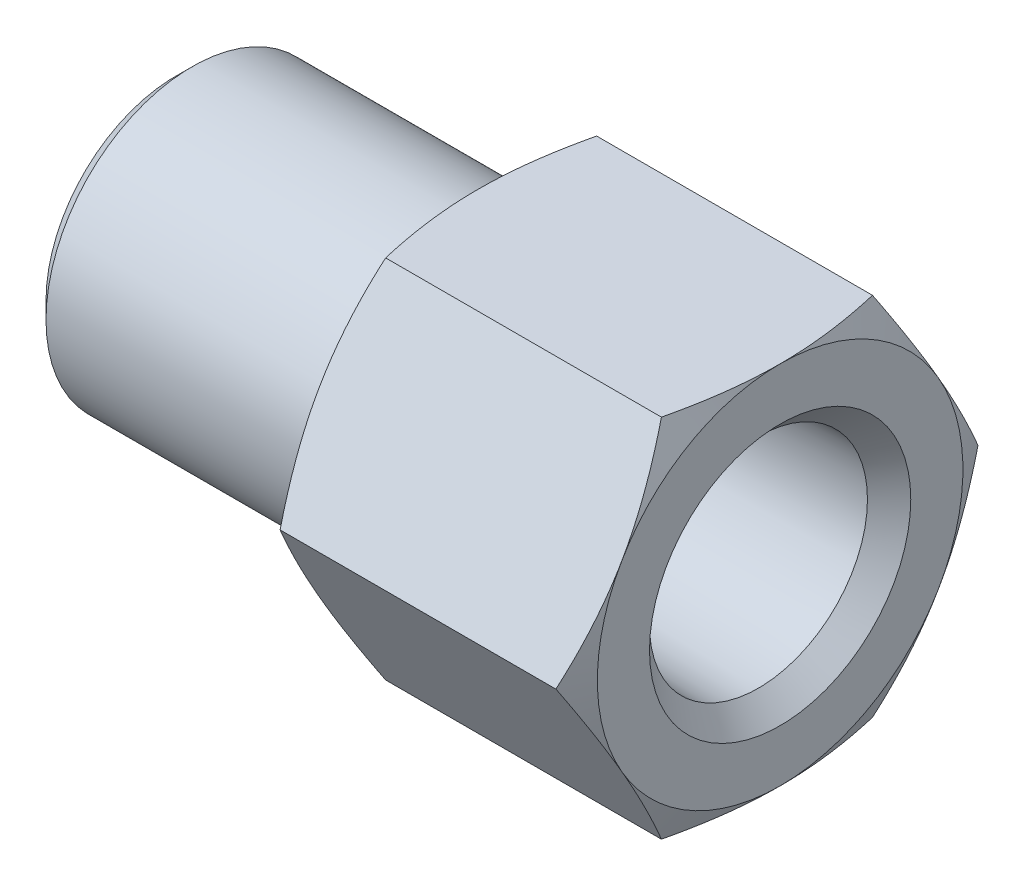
ISO-10303-21;
HEADER;
FILE_DESCRIPTION(('STEP AP214'),'2;1');
FILE_NAME('part.step','',(''),(''),'','','');
FILE_SCHEMA(('AUTOMOTIVE_DESIGN { 1 0 10303 214 1 1 1 1 }'));
ENDSEC;
DATA;
#1=APPLICATION_CONTEXT('core data for automotive mechanical design processes');
#2=APPLICATION_PROTOCOL_DEFINITION('international standard','automotive_design',2000,#1);
#3=PRODUCT_CONTEXT('',#1,'mechanical');
#4=PRODUCT('Part','Part','',(#3));
#5=PRODUCT_RELATED_PRODUCT_CATEGORY('part','',(#4));
#6=PRODUCT_DEFINITION_FORMATION('','',#4);
#7=PRODUCT_DEFINITION_CONTEXT('part definition',#1,'design');
#8=PRODUCT_DEFINITION('design','',#6,#7);
#9=PRODUCT_DEFINITION_SHAPE('','',#8);
#10=(LENGTH_UNIT() NAMED_UNIT(*) SI_UNIT(.MILLI.,.METRE.));
#11=(NAMED_UNIT(*) PLANE_ANGLE_UNIT() SI_UNIT($,.RADIAN.));
#12=(NAMED_UNIT(*) SI_UNIT($,.STERADIAN.) SOLID_ANGLE_UNIT());
#13=UNCERTAINTY_MEASURE_WITH_UNIT(LENGTH_MEASURE(1.E-05),#10,'distance_accuracy_value','');
#14=(GEOMETRIC_REPRESENTATION_CONTEXT(3) GLOBAL_UNCERTAINTY_ASSIGNED_CONTEXT((#13)) GLOBAL_UNIT_ASSIGNED_CONTEXT((#10,
#11,#12)) REPRESENTATION_CONTEXT('',''));
#15=CARTESIAN_POINT('',(0.,0.,0.));
#16=DIRECTION('',(0.,0.,1.));
#17=DIRECTION('',(1.,0.,0.));
#18=AXIS2_PLACEMENT_3D('',#15,#16,#17);
#19=CARTESIAN_POINT('',(30.367224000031,0.,0.));
#20=DIRECTION('',(1.,0.,0.));
#21=DIRECTION('',(0.,1.,0.));
#22=AXIS2_PLACEMENT_3D('',#19,#20,#21);
#23=CONICAL_SURFACE('',#22,5.67931300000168,0.0256563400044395);
#24=CARTESIAN_POINT('',(21.4756999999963,0.,0.));
#25=DIRECTION('',(1.,0.,0.));
#26=DIRECTION('',(0.,1.,0.));
#27=AXIS2_PLACEMENT_3D('',#24,#25,#26);
#28=CIRCLE('',#27,5.45113896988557);
#29=CARTESIAN_POINT('',(21.4756999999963,5.45113896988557,0.));
#30=VERTEX_POINT('',#29);
#31=EDGE_CURVE('E19',#30,#30,#28,.F.);
#32=ORIENTED_EDGE('',*,*,#31,.T.);
#33=EDGE_LOOP('',(#32));
#34=FACE_BOUND('',#33,.T.);
#35=CARTESIAN_POINT('',(30.3672239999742,0.,0.));
#36=DIRECTION('',(1.,0.,0.));
#37=DIRECTION('',(0.,0.,-1.));
#38=AXIS2_PLACEMENT_3D('',#35,#36,#37);
#39=CIRCLE('',#38,5.67931299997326);
#40=CARTESIAN_POINT('',(30.3672239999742,0.,-5.67931299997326));
#41=VERTEX_POINT('',#40);
#42=EDGE_CURVE('E386',#41,#41,#39,.T.);
#43=ORIENTED_EDGE('',*,*,#42,.T.);
#44=EDGE_LOOP('',(#43));
#45=FACE_BOUND('',#44,.T.);
#46=ADVANCED_FACE('F16',(#34,#45),#23,.F.);
#47=CARTESIAN_POINT('',(21.4757,0.,0.));
#48=DIRECTION('',(-1.,0.,0.));
#49=DIRECTION('',(0.,0.,1.));
#50=AXIS2_PLACEMENT_3D('',#47,#48,#49);
#51=PLANE('',#50);
#52=ORIENTED_EDGE('',*,*,#31,.F.);
#53=EDGE_LOOP('',(#52));
#54=FACE_BOUND('',#53,.T.);
#55=CARTESIAN_POINT('',(21.4757,0.,0.));
#56=DIRECTION('',(1.,0.,0.));
#57=DIRECTION('',(0.,0.,-1.));
#58=AXIS2_PLACEMENT_3D('',#55,#56,#57);
#59=CIRCLE('',#58,3.556);
#60=CARTESIAN_POINT('',(21.4757,0.,-3.556));
#61=VERTEX_POINT('',#60);
#62=EDGE_CURVE('E388',#61,#61,#59,.F.);
#63=ORIENTED_EDGE('',*,*,#62,.T.);
#64=EDGE_LOOP('',(#63));
#65=FACE_BOUND('',#64,.T.);
#66=ADVANCED_FACE('F568',(#54,#65),#51,.F.);
#67=CARTESIAN_POINT('',(31.4960000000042,0.,0.));
#68=DIRECTION('',(1.,0.,0.));
#69=DIRECTION('',(0.,0.,-1.));
#70=AXIS2_PLACEMENT_3D('',#67,#68,#69);
#71=CONICAL_SURFACE('',#70,6.80808900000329,0.785398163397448);
#72=ORIENTED_EDGE('',*,*,#42,.F.);
#73=EDGE_LOOP('',(#72));
#74=FACE_BOUND('',#73,.T.);
#75=CARTESIAN_POINT('',(31.4960000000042,0.,0.));
#76=DIRECTION('',(1.,0.,0.));
#77=DIRECTION('',(0.,0.,-1.));
#78=AXIS2_PLACEMENT_3D('',#75,#76,#77);
#79=CIRCLE('',#78,6.80808900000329);
#80=CARTESIAN_POINT('',(31.4960000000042,0.,-6.80808900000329));
#81=VERTEX_POINT('',#80);
#82=EDGE_CURVE('E739',#81,#81,#79,.F.);
#83=ORIENTED_EDGE('',*,*,#82,.F.);
#84=EDGE_LOOP('',(#83));
#85=FACE_BOUND('',#84,.T.);
#86=ADVANCED_FACE('F560',(#74,#85),#71,.F.);
#87=CARTESIAN_POINT('',(23.622,0.,0.));
#88=DIRECTION('',(1.,0.,0.));
#89=DIRECTION('',(0.,0.,-1.));
#90=AXIS2_PLACEMENT_3D('',#87,#88,#89);
#91=CYLINDRICAL_SURFACE('',#90,3.556);
#92=ORIENTED_EDGE('',*,*,#62,.F.);
#93=EDGE_LOOP('',(#92));
#94=FACE_BOUND('',#93,.T.);
#95=CARTESIAN_POINT('',(7.874,0.,0.));
#96=DIRECTION('',(1.,0.,0.));
#97=DIRECTION('',(0.,0.,-1.));
#98=AXIS2_PLACEMENT_3D('',#95,#96,#97);
#99=CIRCLE('',#98,3.556);
#100=CARTESIAN_POINT('',(7.874,0.,-3.556));
#101=VERTEX_POINT('',#100);
#102=EDGE_CURVE('E131',#101,#101,#99,.F.);
#103=ORIENTED_EDGE('',*,*,#102,.T.);
#104=EDGE_LOOP('',(#103));
#105=FACE_BOUND('',#104,.T.);
#106=ADVANCED_FACE('F554',(#94,#105),#91,.F.);
#107=CARTESIAN_POINT('',(31.496,0.,4.7625));
#108=DIRECTION('',(1.,0.,0.));
#109=DIRECTION('',(0.,1.,0.));
#110=AXIS2_PLACEMENT_3D('',#107,#108,#109);
#111=PLANE('',#110);
#112=CARTESIAN_POINT('',(31.496,0.,0.));
#113=DIRECTION('',(-1.,0.,0.));
#114=DIRECTION('',(0.,0.,1.));
#115=AXIS2_PLACEMENT_3D('',#112,#113,#114);
#116=CIRCLE('',#115,9.525);
#117=CARTESIAN_POINT('',(31.496,4.7625,-8.24889197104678));
#118=VERTEX_POINT('',#117);
#119=CARTESIAN_POINT('',(31.496,-4.7625,-8.24889197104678));
#120=VERTEX_POINT('',#119);
#121=EDGE_CURVE('E104',#118,#120,#116,.T.);
#122=ORIENTED_EDGE('',*,*,#121,.F.);
#123=CARTESIAN_POINT('',(31.496,0.,0.));
#124=DIRECTION('',(-1.,0.,0.));
#125=DIRECTION('',(0.,0.,1.));
#126=AXIS2_PLACEMENT_3D('',#123,#124,#125);
#127=CIRCLE('',#126,9.525);
#128=CARTESIAN_POINT('',(31.496,9.525,0.));
#129=VERTEX_POINT('',#128);
#130=EDGE_CURVE('E101',#129,#118,#127,.T.);
#131=ORIENTED_EDGE('',*,*,#130,.F.);
#132=CARTESIAN_POINT('',(31.496,0.,0.));
#133=DIRECTION('',(-1.,0.,0.));
#134=DIRECTION('',(0.,0.,1.));
#135=AXIS2_PLACEMENT_3D('',#132,#133,#134);
#136=CIRCLE('',#135,9.52499999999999);
#137=CARTESIAN_POINT('',(31.496,4.76250000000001,8.24889197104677));
#138=VERTEX_POINT('',#137);
#139=EDGE_CURVE('E746',#138,#129,#136,.T.);
#140=ORIENTED_EDGE('',*,*,#139,.F.);
#141=CARTESIAN_POINT('',(31.496,0.,0.));
#142=DIRECTION('',(-1.,0.,0.));
#143=DIRECTION('',(0.,0.,1.));
#144=AXIS2_PLACEMENT_3D('',#141,#142,#143);
#145=CIRCLE('',#144,9.52499999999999);
#146=CARTESIAN_POINT('',(31.496,-4.76249999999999,8.24889197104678));
#147=VERTEX_POINT('',#146);
#148=EDGE_CURVE('E751',#147,#138,#145,.T.);
#149=ORIENTED_EDGE('',*,*,#148,.F.);
#150=CARTESIAN_POINT('',(31.496,0.,0.));
#151=DIRECTION('',(-1.,0.,0.));
#152=DIRECTION('',(0.,0.,1.));
#153=AXIS2_PLACEMENT_3D('',#150,#151,#152);
#154=CIRCLE('',#153,9.525);
#155=CARTESIAN_POINT('',(31.496,-9.525,0.));
#156=VERTEX_POINT('',#155);
#157=EDGE_CURVE('E748',#156,#147,#154,.T.);
#158=ORIENTED_EDGE('',*,*,#157,.F.);
#159=CARTESIAN_POINT('',(31.496,0.,0.));
#160=DIRECTION('',(-1.,0.,0.));
#161=DIRECTION('',(0.,0.,1.));
#162=AXIS2_PLACEMENT_3D('',#159,#160,#161);
#163=CIRCLE('',#162,9.525);
#164=EDGE_CURVE('E109',#120,#156,#163,.T.);
#165=ORIENTED_EDGE('',*,*,#164,.F.);
#166=EDGE_LOOP('',(#122,#131,#140,#149,#158,#165));
#167=FACE_BOUND('',#166,.T.);
#168=ORIENTED_EDGE('',*,*,#82,.T.);
#169=EDGE_LOOP('',(#168));
#170=FACE_BOUND('',#169,.T.);
#171=ADVANCED_FACE('F106',(#167,#170),#111,.T.);
#172=CARTESIAN_POINT('',(7.874,0.,0.));
#173=DIRECTION('',(1.,0.,0.));
#174=DIRECTION('',(0.,1.,0.));
#175=AXIS2_PLACEMENT_3D('',#172,#173,#174);
#176=PLANE('',#175);
#177=CARTESIAN_POINT('',(7.874,0.,0.));
#178=DIRECTION('',(1.,0.,0.));
#179=DIRECTION('',(0.,0.,-1.));
#180=AXIS2_PLACEMENT_3D('',#177,#178,#179);
#181=CIRCLE('',#180,4.7625);
#182=CARTESIAN_POINT('',(7.874,0.,-4.7625));
#183=VERTEX_POINT('',#182);
#184=EDGE_CURVE('E753',#183,#183,#181,.F.);
#185=ORIENTED_EDGE('',*,*,#184,.T.);
#186=EDGE_LOOP('',(#185));
#187=FACE_BOUND('',#186,.T.);
#188=ORIENTED_EDGE('',*,*,#102,.F.);
#189=EDGE_LOOP('',(#188));
#190=FACE_BOUND('',#189,.T.);
#191=ADVANCED_FACE('F160',(#187,#190),#176,.F.);
#192=CARTESIAN_POINT('',(30.8047624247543,0.,0.));
#193=DIRECTION('',(-1.,0.,0.));
#194=DIRECTION('',(0.,0.,1.));
#195=AXIS2_PLACEMENT_3D('',#192,#193,#194);
#196=CONICAL_SURFACE('',#195,11.0073637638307,1.13446401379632);
#197=CARTESIAN_POINT('',(31.496,9.525,0.));
#198=CARTESIAN_POINT('',(31.4960275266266,9.525,-0.231936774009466));
#199=CARTESIAN_POINT('',(31.4920502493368,9.525,-0.463867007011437));
#200=CARTESIAN_POINT('',(31.4762898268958,9.525,-0.927436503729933));
#201=CARTESIAN_POINT('',(31.4645075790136,9.525,-1.1590757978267));
#202=CARTESIAN_POINT('',(31.4333927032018,9.525,-1.62106931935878));
#203=CARTESIAN_POINT('',(31.414085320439,9.525,-1.85142525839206));
#204=CARTESIAN_POINT('',(31.3682940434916,9.525,-2.31142034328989));
#205=CARTESIAN_POINT('',(31.3418100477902,9.525,-2.54105947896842));
#206=CARTESIAN_POINT('',(31.2523093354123,9.525,-3.22827483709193));
#207=CARTESIAN_POINT('',(31.179216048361,9.525,-3.68454136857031));
#208=CARTESIAN_POINT('',(31.0101598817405,9.525,-4.59444540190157));
#209=CARTESIAN_POINT('',(30.9141207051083,9.525,-5.04806884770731));
#210=CARTESIAN_POINT('',(30.8088851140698,9.525,-5.49926131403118));
#211=B_SPLINE_CURVE_WITH_KNOTS('',3,(#197,#198,#199,#200,#201,#202,#203,#204,#205,#206,#207,
#208,#209,#210),.UNSPECIFIED.,.F.,.F.,(4,2,2,2,2,2,4),(0.,0.695765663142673,1.39145135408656,
2.08482298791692,2.77820443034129,4.1637893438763,5.55404718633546),.UNSPECIFIED.);
#212=CARTESIAN_POINT('',(30.8088851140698,9.525,-5.49926131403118));
#213=VERTEX_POINT('',#212);
#214=EDGE_CURVE('E122',#129,#213,#211,.T.);
#215=ORIENTED_EDGE('',*,*,#214,.F.);
#216=ORIENTED_EDGE('',*,*,#130,.T.);
#217=CARTESIAN_POINT('',(30.8088851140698,9.525,-5.49926131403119));
#218=CARTESIAN_POINT('',(30.9141207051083,9.13425586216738,-5.72485754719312));
#219=CARTESIAN_POINT('',(31.0101598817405,8.74140643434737,-5.95166927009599));
#220=CARTESIAN_POINT('',(31.179216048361,7.95340642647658,-6.40662128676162));
#221=CARTESIAN_POINT('',(31.2523093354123,7.55826801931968,-6.63475455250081));
#222=CARTESIAN_POINT('',(31.3418100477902,6.9631220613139,-6.97836223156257));
#223=CARTESIAN_POINT('',(31.3682940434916,6.7642487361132,-7.09318179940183));
#224=CARTESIAN_POINT('',(31.414085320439,6.3658813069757,-7.32317934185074));
#225=CARTESIAN_POINT('',(31.4333927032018,6.16638721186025,-7.43835731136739));
#226=CARTESIAN_POINT('',(31.4645075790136,5.76628908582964,-7.66935407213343));
#227=CARTESIAN_POINT('',(31.4762898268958,5.56568357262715,-7.78517371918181));
#228=CARTESIAN_POINT('',(31.4920502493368,5.16422061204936,-8.01695846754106));
#229=CARTESIAN_POINT('',(31.4960275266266,4.96336313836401,-8.13292358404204));
#230=CARTESIAN_POINT('',(31.496,4.7625,-8.24889197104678));
#231=B_SPLINE_CURVE_WITH_KNOTS('',3,(#217,#218,#219,#220,#221,#222,#223,#224,#225,#226,#227,
#228,#229,#230),.UNSPECIFIED.,.F.,.F.,(4,2,2,2,2,2,4),(0.,1.39025784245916,2.77584275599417,
3.46922419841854,4.1625958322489,4.85828152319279,5.55404718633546),.UNSPECIFIED.);
#232=EDGE_CURVE('E128',#213,#118,#231,.T.);
#233=ORIENTED_EDGE('',*,*,#232,.F.);
#234=EDGE_LOOP('',(#215,#216,#233));
#235=FACE_BOUND('',#234,.T.);
#236=ADVANCED_FACE('F127',(#235),#196,.T.);
#237=CARTESIAN_POINT('',(30.8047624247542,0.,0.));
#238=DIRECTION('',(-1.,0.,0.));
#239=DIRECTION('',(0.,0.,1.));
#240=AXIS2_PLACEMENT_3D('',#237,#238,#239);
#241=CONICAL_SURFACE('',#240,11.0073637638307,1.13446401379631);
#242=CARTESIAN_POINT('',(31.496,4.7625,-8.24889197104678));
#243=CARTESIAN_POINT('',(31.4960275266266,4.56163686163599,-8.36486035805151));
#244=CARTESIAN_POINT('',(31.4920502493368,4.36077938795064,-8.4808254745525));
#245=CARTESIAN_POINT('',(31.4762898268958,3.95931642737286,-8.71261022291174));
#246=CARTESIAN_POINT('',(31.4645075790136,3.75871091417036,-8.82842986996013));
#247=CARTESIAN_POINT('',(31.4333927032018,3.35861278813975,-9.05942663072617));
#248=CARTESIAN_POINT('',(31.414085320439,3.1591186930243,-9.17460460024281));
#249=CARTESIAN_POINT('',(31.3682940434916,2.7607512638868,-9.40460214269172));
#250=CARTESIAN_POINT('',(31.3418100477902,2.5618779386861,-9.51942171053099));
#251=CARTESIAN_POINT('',(31.2523093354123,1.96673198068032,-9.86302938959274));
#252=CARTESIAN_POINT('',(31.179216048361,1.57159357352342,-10.0911626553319));
#253=CARTESIAN_POINT('',(31.0101598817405,0.783593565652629,-10.5461146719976));
#254=CARTESIAN_POINT('',(30.9141207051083,0.390744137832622,-10.7729263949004));
#255=CARTESIAN_POINT('',(30.8088851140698,0.,-10.9985226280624));
#256=B_SPLINE_CURVE_WITH_KNOTS('',3,(#242,#243,#244,#245,#246,#247,#248,#249,#250,#251,#252,
#253,#254,#255),.UNSPECIFIED.,.F.,.F.,(4,2,2,2,2,2,4),(0.,0.695765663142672,1.39145135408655,
2.08482298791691,2.77820443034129,4.1637893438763,5.55404718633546),.UNSPECIFIED.);
#257=CARTESIAN_POINT('',(30.8088851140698,0.,-10.9985226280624));
#258=VERTEX_POINT('',#257);
#259=EDGE_CURVE('E114',#118,#258,#256,.T.);
#260=ORIENTED_EDGE('',*,*,#259,.F.);
#261=ORIENTED_EDGE('',*,*,#121,.T.);
#262=CARTESIAN_POINT('',(30.8088851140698,0.,-10.9985226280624));
#263=CARTESIAN_POINT('',(30.9141207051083,-0.390744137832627,-10.7729263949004));
#264=CARTESIAN_POINT('',(31.0101598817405,-0.783593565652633,-10.5461146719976));
#265=CARTESIAN_POINT('',(31.179216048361,-1.57159357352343,-10.0911626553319));
#266=CARTESIAN_POINT('',(31.2523093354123,-1.96673198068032,-9.86302938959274));
#267=CARTESIAN_POINT('',(31.3418100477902,-2.5618779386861,-9.51942171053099));
#268=CARTESIAN_POINT('',(31.3682940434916,-2.76075126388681,-9.40460214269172));
#269=CARTESIAN_POINT('',(31.414085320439,-3.15911869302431,-9.17460460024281));
#270=CARTESIAN_POINT('',(31.4333927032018,-3.35861278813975,-9.05942663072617));
#271=CARTESIAN_POINT('',(31.4645075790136,-3.75871091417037,-8.82842986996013));
#272=CARTESIAN_POINT('',(31.4762898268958,-3.95931642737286,-8.71261022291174));
#273=CARTESIAN_POINT('',(31.4920502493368,-4.36077938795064,-8.4808254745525));
#274=CARTESIAN_POINT('',(31.4960275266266,-4.56163686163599,-8.36486035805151));
#275=CARTESIAN_POINT('',(31.496,-4.7625,-8.24889197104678));
#276=B_SPLINE_CURVE_WITH_KNOTS('',3,(#262,#263,#264,#265,#266,#267,#268,#269,#270,#271,#272,
#273,#274,#275),.UNSPECIFIED.,.F.,.F.,(4,2,2,2,2,2,4),(0.,1.39025784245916,2.77584275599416,
3.46922419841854,4.1625958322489,4.85828152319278,5.55404718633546),.UNSPECIFIED.);
#277=EDGE_CURVE('E117',#258,#120,#276,.T.);
#278=ORIENTED_EDGE('',*,*,#277,.F.);
#279=EDGE_LOOP('',(#260,#261,#278));
#280=FACE_BOUND('',#279,.T.);
#281=ADVANCED_FACE('F115',(#280),#241,.T.);
#282=CARTESIAN_POINT('',(30.8047624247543,0.,0.));
#283=DIRECTION('',(-1.,0.,0.));
#284=DIRECTION('',(0.,0.,1.));
#285=AXIS2_PLACEMENT_3D('',#282,#283,#284);
#286=CONICAL_SURFACE('',#285,11.0073637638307,1.13446401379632);
#287=CARTESIAN_POINT('',(31.496,-4.7625,-8.24889197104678));
#288=CARTESIAN_POINT('',(31.4960275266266,-4.96336313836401,-8.13292358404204));
#289=CARTESIAN_POINT('',(31.4920502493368,-5.16422061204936,-8.01695846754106));
#290=CARTESIAN_POINT('',(31.4762898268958,-5.56568357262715,-7.78517371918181));
#291=CARTESIAN_POINT('',(31.4645075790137,-5.76628908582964,-7.66935407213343));
#292=CARTESIAN_POINT('',(31.4333927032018,-6.16638721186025,-7.43835731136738));
#293=CARTESIAN_POINT('',(31.414085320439,-6.3658813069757,-7.32317934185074));
#294=CARTESIAN_POINT('',(31.3682940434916,-6.7642487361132,-7.09318179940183));
#295=CARTESIAN_POINT('',(31.3418100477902,-6.9631220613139,-6.97836223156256));
#296=CARTESIAN_POINT('',(31.2523093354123,-7.55826801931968,-6.63475455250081));
#297=CARTESIAN_POINT('',(31.179216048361,-7.95340642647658,-6.40662128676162));
#298=CARTESIAN_POINT('',(31.0101598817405,-8.74140643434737,-5.95166927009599));
#299=CARTESIAN_POINT('',(30.9141207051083,-9.13425586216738,-5.72485754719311));
#300=CARTESIAN_POINT('',(30.8088851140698,-9.525,-5.49926131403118));
#301=B_SPLINE_CURVE_WITH_KNOTS('',3,(#287,#288,#289,#290,#291,#292,#293,#294,#295,#296,#297,
#298,#299,#300),.UNSPECIFIED.,.F.,.F.,(4,2,2,2,2,2,4),(0.,0.695765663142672,1.39145135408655,
2.08482298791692,2.77820443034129,4.1637893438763,5.55404718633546),.UNSPECIFIED.);
#302=CARTESIAN_POINT('',(30.8088851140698,-9.525,-5.49926131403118));
#303=VERTEX_POINT('',#302);
#304=EDGE_CURVE('E299',#120,#303,#301,.T.);
#305=ORIENTED_EDGE('',*,*,#304,.F.);
#306=ORIENTED_EDGE('',*,*,#164,.T.);
#307=CARTESIAN_POINT('',(30.8088851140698,-9.525,-5.49926131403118));
#308=CARTESIAN_POINT('',(30.9141207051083,-9.525,-5.04806884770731));
#309=CARTESIAN_POINT('',(31.0101598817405,-9.525,-4.59444540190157));
#310=CARTESIAN_POINT('',(31.179216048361,-9.525,-3.68454136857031));
#311=CARTESIAN_POINT('',(31.2523093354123,-9.525,-3.22827483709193));
#312=CARTESIAN_POINT('',(31.3418100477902,-9.525,-2.54105947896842));
#313=CARTESIAN_POINT('',(31.3682940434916,-9.525,-2.31142034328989));
#314=CARTESIAN_POINT('',(31.414085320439,-9.525,-1.85142525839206));
#315=CARTESIAN_POINT('',(31.4333927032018,-9.525,-1.62106931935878));
#316=CARTESIAN_POINT('',(31.4645075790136,-9.525,-1.15907579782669));
#317=CARTESIAN_POINT('',(31.4762898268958,-9.525,-0.927436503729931));
#318=CARTESIAN_POINT('',(31.4920502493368,-9.525,-0.463867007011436));
#319=CARTESIAN_POINT('',(31.4960275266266,-9.525,-0.231936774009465));
#320=CARTESIAN_POINT('',(31.496,-9.525,0.));
#321=B_SPLINE_CURVE_WITH_KNOTS('',3,(#307,#308,#309,#310,#311,#312,#313,#314,#315,#316,#317,
#318,#319,#320),.UNSPECIFIED.,.F.,.F.,(4,2,2,2,2,2,4),(0.,1.39025784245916,2.77584275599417,
3.46922419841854,4.1625958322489,4.85828152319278,5.55404718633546),.UNSPECIFIED.);
#322=EDGE_CURVE('E284',#303,#156,#321,.T.);
#323=ORIENTED_EDGE('',*,*,#322,.F.);
#324=EDGE_LOOP('',(#305,#306,#323));
#325=FACE_BOUND('',#324,.T.);
#326=ADVANCED_FACE('F292',(#325),#286,.T.);
#327=CARTESIAN_POINT('',(30.8047624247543,0.,0.));
#328=DIRECTION('',(-1.,0.,0.));
#329=DIRECTION('',(0.,0.,1.));
#330=AXIS2_PLACEMENT_3D('',#327,#328,#329);
#331=CONICAL_SURFACE('',#330,11.0073637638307,1.13446401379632);
#332=ORIENTED_EDGE('',*,*,#139,.T.);
#333=CARTESIAN_POINT('',(30.8088851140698,9.525,5.49926131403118));
#334=CARTESIAN_POINT('',(30.9141207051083,9.525,5.04806884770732));
#335=CARTESIAN_POINT('',(31.0101598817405,9.525,4.59444540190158));
#336=CARTESIAN_POINT('',(31.179216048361,9.525,3.68454136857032));
#337=CARTESIAN_POINT('',(31.2523093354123,9.525,3.22827483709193));
#338=CARTESIAN_POINT('',(31.3418100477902,9.525,2.54105947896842));
#339=CARTESIAN_POINT('',(31.3682940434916,9.525,2.3114203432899));
#340=CARTESIAN_POINT('',(31.414085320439,9.525,1.85142525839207));
#341=CARTESIAN_POINT('',(31.4333927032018,9.525,1.62106931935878));
#342=CARTESIAN_POINT('',(31.4645075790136,9.525,1.1590757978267));
#343=CARTESIAN_POINT('',(31.4762898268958,9.525,0.927436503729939));
#344=CARTESIAN_POINT('',(31.4920502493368,9.525,0.463867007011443));
#345=CARTESIAN_POINT('',(31.4960275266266,9.525,0.231936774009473));
#346=CARTESIAN_POINT('',(31.496,9.525,0.));
#347=B_SPLINE_CURVE_WITH_KNOTS('',3,(#333,#334,#335,#336,#337,#338,#339,#340,#341,#342,#343,
#344,#345,#346),.UNSPECIFIED.,.F.,.F.,(4,2,2,2,2,2,4),(0.,1.39025784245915,2.77584275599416,
3.46922419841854,4.1625958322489,4.85828152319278,5.55404718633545),.UNSPECIFIED.);
#348=CARTESIAN_POINT('',(30.8088851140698,9.525,5.49926131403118));
#349=VERTEX_POINT('',#348);
#350=EDGE_CURVE('E169',#349,#129,#347,.T.);
#351=ORIENTED_EDGE('',*,*,#350,.F.);
#352=CARTESIAN_POINT('',(31.496,4.76250000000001,8.24889197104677));
#353=CARTESIAN_POINT('',(31.4960275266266,4.96336313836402,8.13292358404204));
#354=CARTESIAN_POINT('',(31.4920502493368,5.16422061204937,8.01695846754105));
#355=CARTESIAN_POINT('',(31.4762898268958,5.56568357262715,7.7851737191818));
#356=CARTESIAN_POINT('',(31.4645075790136,5.76628908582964,7.66935407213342));
#357=CARTESIAN_POINT('',(31.4333927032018,6.16638721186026,7.43835731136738));
#358=CARTESIAN_POINT('',(31.414085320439,6.3658813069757,7.32317934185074));
#359=CARTESIAN_POINT('',(31.3682940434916,6.7642487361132,7.09318179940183));
#360=CARTESIAN_POINT('',(31.3418100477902,6.9631220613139,6.97836223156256));
#361=CARTESIAN_POINT('',(31.2523093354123,7.55826801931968,6.63475455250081));
#362=CARTESIAN_POINT('',(31.179216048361,7.95340642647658,6.40662128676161));
#363=CARTESIAN_POINT('',(31.0101598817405,8.74140643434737,5.95166927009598));
#364=CARTESIAN_POINT('',(30.9141207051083,9.13425586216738,5.72485754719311));
#365=CARTESIAN_POINT('',(30.8088851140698,9.52499999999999,5.49926131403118));
#366=B_SPLINE_CURVE_WITH_KNOTS('',3,(#352,#353,#354,#355,#356,#357,#358,#359,#360,#361,#362,
#363,#364,#365),.UNSPECIFIED.,.F.,.F.,(4,2,2,2,2,2,4),(0.,0.695765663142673,1.39145135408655,
2.08482298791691,2.77820443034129,4.16378934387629,5.55404718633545),.UNSPECIFIED.);
#367=EDGE_CURVE('E278',#138,#349,#366,.T.);
#368=ORIENTED_EDGE('',*,*,#367,.F.);
#369=EDGE_LOOP('',(#332,#351,#368));
#370=FACE_BOUND('',#369,.T.);
#371=ADVANCED_FACE('F289',(#370),#331,.T.);
#372=CARTESIAN_POINT('',(30.8047624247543,0.,0.));
#373=DIRECTION('',(-1.,0.,0.));
#374=DIRECTION('',(0.,0.,1.));
#375=AXIS2_PLACEMENT_3D('',#372,#373,#374);
#376=CONICAL_SURFACE('',#375,11.0073637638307,1.13446401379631);
#377=CARTESIAN_POINT('',(31.496,-9.525,0.));
#378=CARTESIAN_POINT('',(31.4960275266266,-9.525,0.231936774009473));
#379=CARTESIAN_POINT('',(31.4920502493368,-9.525,0.463867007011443));
#380=CARTESIAN_POINT('',(31.4762898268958,-9.525,0.927436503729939));
#381=CARTESIAN_POINT('',(31.4645075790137,-9.525,1.1590757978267));
#382=CARTESIAN_POINT('',(31.4333927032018,-9.525,1.62106931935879));
#383=CARTESIAN_POINT('',(31.414085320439,-9.525,1.85142525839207));
#384=CARTESIAN_POINT('',(31.3682940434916,-9.525,2.3114203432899));
#385=CARTESIAN_POINT('',(31.3418100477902,-9.525,2.54105947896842));
#386=CARTESIAN_POINT('',(31.2523093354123,-9.525,3.22827483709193));
#387=CARTESIAN_POINT('',(31.179216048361,-9.525,3.68454136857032));
#388=CARTESIAN_POINT('',(31.0101598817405,-9.525,4.59444540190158));
#389=CARTESIAN_POINT('',(30.9141207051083,-9.525,5.04806884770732));
#390=CARTESIAN_POINT('',(30.8088851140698,-9.525,5.49926131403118));
#391=B_SPLINE_CURVE_WITH_KNOTS('',3,(#377,#378,#379,#380,#381,#382,#383,#384,#385,#386,#387,
#388,#389,#390),.UNSPECIFIED.,.F.,.F.,(4,2,2,2,2,2,4),(0.,0.695765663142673,1.39145135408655,
2.08482298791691,2.77820443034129,4.1637893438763,5.55404718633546),.UNSPECIFIED.);
#392=CARTESIAN_POINT('',(30.8088851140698,-9.525,5.49926131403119));
#393=VERTEX_POINT('',#392);
#394=EDGE_CURVE('E303',#156,#393,#391,.T.);
#395=ORIENTED_EDGE('',*,*,#394,.F.);
#396=ORIENTED_EDGE('',*,*,#157,.T.);
#397=CARTESIAN_POINT('',(30.8088851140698,-9.525,5.49926131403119));
#398=CARTESIAN_POINT('',(30.9141207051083,-9.13425586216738,5.72485754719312));
#399=CARTESIAN_POINT('',(31.0101598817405,-8.74140643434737,5.95166927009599));
#400=CARTESIAN_POINT('',(31.179216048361,-7.95340642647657,6.40662128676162));
#401=CARTESIAN_POINT('',(31.2523093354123,-7.55826801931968,6.63475455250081));
#402=CARTESIAN_POINT('',(31.3418100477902,-6.9631220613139,6.97836223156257));
#403=CARTESIAN_POINT('',(31.3682940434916,-6.76424873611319,7.09318179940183));
#404=CARTESIAN_POINT('',(31.414085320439,-6.36588130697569,7.32317934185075));
#405=CARTESIAN_POINT('',(31.4333927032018,-6.16638721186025,7.43835731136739));
#406=CARTESIAN_POINT('',(31.4645075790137,-5.76628908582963,7.66935407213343));
#407=CARTESIAN_POINT('',(31.4762898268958,-5.56568357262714,7.78517371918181));
#408=CARTESIAN_POINT('',(31.4920502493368,-5.16422061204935,8.01695846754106));
#409=CARTESIAN_POINT('',(31.4960275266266,-4.963363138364,8.13292358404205));
#410=CARTESIAN_POINT('',(31.496,-4.76249999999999,8.24889197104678));
#411=B_SPLINE_CURVE_WITH_KNOTS('',3,(#397,#398,#399,#400,#401,#402,#403,#404,#405,#406,#407,
#408,#409,#410),.UNSPECIFIED.,.F.,.F.,(4,2,2,2,2,2,4),(0.,1.39025784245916,2.77584275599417,
3.46922419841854,4.16259583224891,4.85828152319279,5.55404718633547),.UNSPECIFIED.);
#412=EDGE_CURVE('E256',#393,#147,#411,.T.);
#413=ORIENTED_EDGE('',*,*,#412,.F.);
#414=EDGE_LOOP('',(#395,#396,#413));
#415=FACE_BOUND('',#414,.T.);
#416=ADVANCED_FACE('F266',(#415),#376,.T.);
#417=CARTESIAN_POINT('',(30.8047624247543,0.,0.));
#418=DIRECTION('',(-1.,0.,0.));
#419=DIRECTION('',(0.,0.,1.));
#420=AXIS2_PLACEMENT_3D('',#417,#418,#419);
#421=CONICAL_SURFACE('',#420,11.0073637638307,1.13446401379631);
#422=CARTESIAN_POINT('',(31.496,-4.76249999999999,8.24889197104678));
#423=CARTESIAN_POINT('',(31.4960275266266,-4.56163686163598,8.36486035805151));
#424=CARTESIAN_POINT('',(31.4920502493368,-4.36077938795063,8.4808254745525));
#425=CARTESIAN_POINT('',(31.4762898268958,-3.95931642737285,8.71261022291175));
#426=CARTESIAN_POINT('',(31.4645075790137,-3.75871091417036,8.82842986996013));
#427=CARTESIAN_POINT('',(31.4333927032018,-3.35861278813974,9.05942663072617));
#428=CARTESIAN_POINT('',(31.414085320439,-3.1591186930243,9.17460460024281));
#429=CARTESIAN_POINT('',(31.3682940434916,-2.7607512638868,9.40460214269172));
#430=CARTESIAN_POINT('',(31.3418100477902,-2.56187793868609,9.51942171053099));
#431=CARTESIAN_POINT('',(31.2523093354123,-1.96673198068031,9.86302938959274));
#432=CARTESIAN_POINT('',(31.179216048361,-1.57159357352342,10.0911626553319));
#433=CARTESIAN_POINT('',(31.0101598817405,-0.783593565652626,10.5461146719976));
#434=CARTESIAN_POINT('',(30.9141207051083,-0.39074413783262,10.7729263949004));
#435=CARTESIAN_POINT('',(30.8088851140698,0.,10.9985226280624));
#436=B_SPLINE_CURVE_WITH_KNOTS('',3,(#422,#423,#424,#425,#426,#427,#428,#429,#430,#431,#432,
#433,#434,#435),.UNSPECIFIED.,.F.,.F.,(4,2,2,2,2,2,4),(0.,0.695765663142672,1.39145135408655,
2.08482298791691,2.77820443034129,4.1637893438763,5.55404718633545),.UNSPECIFIED.);
#437=CARTESIAN_POINT('',(30.8088851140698,0.,10.9985226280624));
#438=VERTEX_POINT('',#437);
#439=EDGE_CURVE('E250',#147,#438,#436,.T.);
#440=ORIENTED_EDGE('',*,*,#439,.F.);
#441=ORIENTED_EDGE('',*,*,#148,.T.);
#442=CARTESIAN_POINT('',(30.8088851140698,0.,10.9985226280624));
#443=CARTESIAN_POINT('',(30.9141207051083,0.39074413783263,10.7729263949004));
#444=CARTESIAN_POINT('',(31.0101598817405,0.783593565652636,10.5461146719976));
#445=CARTESIAN_POINT('',(31.179216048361,1.57159357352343,10.0911626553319));
#446=CARTESIAN_POINT('',(31.2523093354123,1.96673198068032,9.86302938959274));
#447=CARTESIAN_POINT('',(31.3418100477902,2.5618779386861,9.51942171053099));
#448=CARTESIAN_POINT('',(31.3682940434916,2.76075126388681,9.40460214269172));
#449=CARTESIAN_POINT('',(31.414085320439,3.15911869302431,9.17460460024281));
#450=CARTESIAN_POINT('',(31.4333927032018,3.35861278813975,9.05942663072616));
#451=CARTESIAN_POINT('',(31.4645075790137,3.75871091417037,8.82842986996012));
#452=CARTESIAN_POINT('',(31.4762898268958,3.95931642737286,8.71261022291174));
#453=CARTESIAN_POINT('',(31.4920502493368,4.36077938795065,8.48082547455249));
#454=CARTESIAN_POINT('',(31.4960275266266,4.561636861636,8.36486035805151));
#455=CARTESIAN_POINT('',(31.496,4.76250000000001,8.24889197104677));
#456=B_SPLINE_CURVE_WITH_KNOTS('',3,(#442,#443,#444,#445,#446,#447,#448,#449,#450,#451,#452,
#453,#454,#455),.UNSPECIFIED.,.F.,.F.,(4,2,2,2,2,2,4),(0.,1.39025784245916,2.77584275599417,
3.46922419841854,4.1625958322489,4.85828152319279,5.55404718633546),.UNSPECIFIED.);
#457=EDGE_CURVE('E270',#438,#138,#456,.T.);
#458=ORIENTED_EDGE('',*,*,#457,.F.);
#459=EDGE_LOOP('',(#440,#441,#458));
#460=FACE_BOUND('',#459,.T.);
#461=ADVANCED_FACE('F263',(#460),#421,.T.);
#462=CARTESIAN_POINT('',(3.937,0.,0.));
#463=DIRECTION('',(1.,0.,0.));
#464=DIRECTION('',(0.,0.,-1.));
#465=AXIS2_PLACEMENT_3D('',#462,#463,#464);
#466=CYLINDRICAL_SURFACE('',#465,4.7625);
#467=CARTESIAN_POINT('',(0.,0.,0.));
#468=DIRECTION('',(1.,0.,0.));
#469=DIRECTION('',(0.,0.,-1.));
#470=AXIS2_PLACEMENT_3D('',#467,#468,#469);
#471=CIRCLE('',#470,4.7625);
#472=CARTESIAN_POINT('',(0.,0.,-4.7625));
#473=VERTEX_POINT('',#472);
#474=EDGE_CURVE('E257',#473,#473,#471,.T.);
#475=ORIENTED_EDGE('',*,*,#474,.F.);
#476=EDGE_LOOP('',(#475));
#477=FACE_BOUND('',#476,.T.);
#478=ORIENTED_EDGE('',*,*,#184,.F.);
#479=EDGE_LOOP('',(#478));
#480=FACE_BOUND('',#479,.T.);
#481=ADVANCED_FACE('F179',(#477,#480),#466,.F.);
#482=CARTESIAN_POINT('',(23.622,9.525,0.));
#483=DIRECTION('',(0.,1.,0.));
#484=DIRECTION('',(0.,0.,1.));
#485=AXIS2_PLACEMENT_3D('',#482,#483,#484);
#486=PLANE('',#485);
#487=DIRECTION('',(1.,0.,0.));
#488=VECTOR('',#487,1.);
#489=CARTESIAN_POINT('',(23.622,9.52500000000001,-5.49926131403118));
#490=LINE('',#489,#488);
#491=CARTESIAN_POINT('',(16.4351148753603,9.52499996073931,-5.49926133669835));
#492=VERTEX_POINT('',#491);
#493=EDGE_CURVE('E121',#492,#213,#490,.T.);
#494=ORIENTED_EDGE('',*,*,#493,.F.);
#495=CARTESIAN_POINT('',(15.748,9.525,0.));
#496=CARTESIAN_POINT('',(15.7479724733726,9.525,-0.231936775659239));
#497=CARTESIAN_POINT('',(15.7519497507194,9.525,-0.463867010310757));
#498=CARTESIAN_POINT('',(15.767710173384,9.525,-0.927436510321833));
#499=CARTESIAN_POINT('',(15.7794924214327,9.525,-1.15907580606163));
#500=CARTESIAN_POINT('',(15.8106072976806,9.525,-1.62106933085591));
#501=CARTESIAN_POINT('',(15.829914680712,9.525,-1.85142527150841));
#502=CARTESIAN_POINT('',(15.8757059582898,9.525,-2.31142035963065));
#503=CARTESIAN_POINT('',(15.9021899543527,9.525,-2.54105949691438));
#504=CARTESIAN_POINT('',(15.991690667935,9.525,-3.22827485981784));
#505=CARTESIAN_POINT('',(16.0647839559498,9.525,-3.68454139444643));
#506=CARTESIAN_POINT('',(16.233840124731,9.525,-4.59444543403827));
#507=CARTESIAN_POINT('',(16.3298793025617,9.525,-5.04806888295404));
#508=CARTESIAN_POINT('',(16.4351148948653,9.525,-5.49926135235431));
#509=B_SPLINE_CURVE_WITH_KNOTS('',3,(#495,#496,#497,#498,#499,#500,#501,#502,#503,#504,#505,
#506,#507,#508),.UNSPECIFIED.,.F.,.F.,(4,2,2,2,2,2,4),(0.,0.695765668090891,1.39145136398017,
2.08482300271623,2.77820445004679,4.16378937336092,5.55404722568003),.UNSPECIFIED.);
#510=CARTESIAN_POINT('',(15.748,9.525,0.));
#511=VERTEX_POINT('',#510);
#512=EDGE_CURVE('E185',#511,#492,#509,.T.);
#513=ORIENTED_EDGE('',*,*,#512,.F.);
#514=CARTESIAN_POINT('',(16.4351148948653,9.525,5.4992613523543));
#515=CARTESIAN_POINT('',(16.3298793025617,9.525,5.04806888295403));
#516=CARTESIAN_POINT('',(16.233840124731,9.525,4.59444543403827));
#517=CARTESIAN_POINT('',(16.0647839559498,9.525,3.68454139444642));
#518=CARTESIAN_POINT('',(15.991690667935,9.525,3.22827485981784));
#519=CARTESIAN_POINT('',(15.9021899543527,9.525,2.54105949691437));
#520=CARTESIAN_POINT('',(15.8757059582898,9.525,2.31142035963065));
#521=CARTESIAN_POINT('',(15.829914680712,9.525,1.85142527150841));
#522=CARTESIAN_POINT('',(15.8106072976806,9.525,1.62106933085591));
#523=CARTESIAN_POINT('',(15.7794924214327,9.525,1.15907580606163));
#524=CARTESIAN_POINT('',(15.767710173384,9.525,0.927436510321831));
#525=CARTESIAN_POINT('',(15.7519497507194,9.525,0.463867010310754));
#526=CARTESIAN_POINT('',(15.7479724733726,9.525,0.231936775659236));
#527=CARTESIAN_POINT('',(15.748,9.525,0.));
#528=B_SPLINE_CURVE_WITH_KNOTS('',3,(#514,#515,#516,#517,#518,#519,#520,#521,#522,#523,#524,
#525,#526,#527),.UNSPECIFIED.,.F.,.F.,(4,2,2,2,2,2,4),(0.,1.39025785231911,2.77584277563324,
3.4692242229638,4.16259586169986,4.85828155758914,5.55404722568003),.UNSPECIFIED.);
#529=CARTESIAN_POINT('',(16.4351148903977,9.525,5.49926133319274));
#530=VERTEX_POINT('',#529);
#531=EDGE_CURVE('E194',#530,#511,#528,.T.);
#532=ORIENTED_EDGE('',*,*,#531,.F.);
#533=DIRECTION('',(1.,0.,0.));
#534=VECTOR('',#533,1.);
#535=CARTESIAN_POINT('',(23.622,9.525,5.49926131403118));
#536=LINE('',#535,#534);
#537=EDGE_CURVE('E277',#349,#530,#536,.F.);
#538=ORIENTED_EDGE('',*,*,#537,.F.);
#539=ORIENTED_EDGE('',*,*,#350,.T.);
#540=ORIENTED_EDGE('',*,*,#214,.T.);
#541=EDGE_LOOP('',(#494,#513,#532,#538,#539,#540));
#542=FACE_BOUND('',#541,.T.);
#543=ADVANCED_FACE('F175',(#542),#486,.T.);
#544=CARTESIAN_POINT('',(23.622,4.7625,-8.24889197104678));
#545=DIRECTION('',(0.,0.5,-0.866025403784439));
#546=DIRECTION('',(0.,0.866025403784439,0.5));
#547=AXIS2_PLACEMENT_3D('',#544,#545,#546);
#548=PLANE('',#547);
#549=ORIENTED_EDGE('',*,*,#493,.T.);
#550=ORIENTED_EDGE('',*,*,#232,.T.);
#551=ORIENTED_EDGE('',*,*,#259,.T.);
#552=DIRECTION('',(1.,0.,0.));
#553=VECTOR('',#552,1.);
#554=CARTESIAN_POINT('',(23.622,0.,-10.9985226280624));
#555=LINE('',#554,#553);
#556=CARTESIAN_POINT('',(16.435114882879,-1.13331422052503E-08,-10.9985226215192));
#557=VERTEX_POINT('',#556);
#558=EDGE_CURVE('E135',#557,#258,#555,.T.);
#559=ORIENTED_EDGE('',*,*,#558,.F.);
#560=CARTESIAN_POINT('',(15.748,4.7625,-8.24889197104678));
#561=CARTESIAN_POINT('',(15.7479724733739,4.56163686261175,-8.36486035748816));
#562=CARTESIAN_POINT('',(15.7519497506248,4.36077938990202,-8.48082547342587));
#563=CARTESIAN_POINT('',(15.7677101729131,3.95931643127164,-8.71261022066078));
#564=CARTESIAN_POINT('',(15.7794924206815,3.75871091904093,-8.82842986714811));
#565=CARTESIAN_POINT('',(15.8106072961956,3.35861279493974,-9.05942662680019));
#566=CARTESIAN_POINT('',(15.8299146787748,3.15911870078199,-9.17460459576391));
#567=CARTESIAN_POINT('',(15.8757059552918,2.76075127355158,-9.40460213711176));
#568=CARTESIAN_POINT('',(15.9021899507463,2.56187794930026,-9.51942170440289));
#569=CARTESIAN_POINT('',(15.9916906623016,1.9667319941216,-9.86302938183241));
#570=CARTESIAN_POINT('',(16.0647839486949,1.57159358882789,-10.0911626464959));
#571=CARTESIAN_POINT('',(16.2338401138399,0.783593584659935,-10.5461146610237));
#572=CARTESIAN_POINT('',(16.3298792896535,0.390744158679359,-10.7729263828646));
#573=CARTESIAN_POINT('',(16.4351148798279,2.26662870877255E-08,-10.998522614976));
#574=B_SPLINE_CURVE_WITH_KNOTS('',3,(#560,#561,#562,#563,#564,#565,#566,#567,#568,#569,#570,
#571,#572,#573),.UNSPECIFIED.,.F.,.F.,(4,2,2,2,2,2,4),(0.,0.695765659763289,1.39145134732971,
2.08482297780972,2.77820441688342,4.16378932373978,5.55404715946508),.UNSPECIFIED.);
#575=CARTESIAN_POINT('',(15.748,4.76249999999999,-8.24889197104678));
#576=VERTEX_POINT('',#575);
#577=EDGE_CURVE('E328',#576,#557,#574,.T.);
#578=ORIENTED_EDGE('',*,*,#577,.F.);
#579=CARTESIAN_POINT('',(16.4351148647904,9.52499992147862,-5.49926135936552));
#580=CARTESIAN_POINT('',(16.3298792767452,9.13425578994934,-5.72485758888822));
#581=CARTESIAN_POINT('',(16.2338401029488,8.74140636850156,-5.95166930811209));
#582=CARTESIAN_POINT('',(16.0647839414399,7.95340637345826,-6.40662131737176));
#583=CARTESIAN_POINT('',(15.9916906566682,7.5582679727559,-6.63475457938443));
#584=CARTESIAN_POINT('',(15.9021899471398,6.96312202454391,-6.97836225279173));
#585=CARTESIAN_POINT('',(15.8757059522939,6.76424870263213,-7.09318181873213));
#586=CARTESIAN_POINT('',(15.8299146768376,6.36588128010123,-7.32317935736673));
#587=CARTESIAN_POINT('',(15.8106072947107,6.16638718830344,-7.43835732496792));
#588=CARTESIAN_POINT('',(15.7794924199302,5.76628906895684,-7.66935408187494));
#589=CARTESIAN_POINT('',(15.7677101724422,5.56568355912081,-7.78517372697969));
#590=CARTESIAN_POINT('',(15.7519497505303,5.16422060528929,-8.01695847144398));
#591=CARTESIAN_POINT('',(15.7479724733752,4.96336313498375,-8.13292358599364));
#592=CARTESIAN_POINT('',(15.748,4.7625,-8.24889197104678));
#593=B_SPLINE_CURVE_WITH_KNOTS('',3,(#579,#580,#581,#582,#583,#584,#585,#586,#587,#588,#589,
#590,#591,#592),.UNSPECIFIED.,.F.,.F.,(4,2,2,2,2,2,4),(0.,1.3902578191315,2.77584270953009,
3.46922414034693,4.16259576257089,4.85828144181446,5.55404709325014),.UNSPECIFIED.);
#594=EDGE_CURVE('E201',#492,#576,#593,.T.);
#595=ORIENTED_EDGE('',*,*,#594,.F.);
#596=EDGE_LOOP('',(#549,#550,#551,#559,#578,#595));
#597=FACE_BOUND('',#596,.T.);
#598=ADVANCED_FACE('F133',(#597),#548,.T.);
#599=CARTESIAN_POINT('',(23.622,-4.7625,-8.24889197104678));
#600=DIRECTION('',(0.,-0.5,-0.866025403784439));
#601=DIRECTION('',(0.,0.866025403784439,-0.5));
#602=AXIS2_PLACEMENT_3D('',#599,#600,#601);
#603=PLANE('',#602);
#604=CARTESIAN_POINT('',(15.748,-4.7625,-8.24889197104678));
#605=CARTESIAN_POINT('',(15.7479724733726,-4.96336313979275,-8.13292358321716));
#606=CARTESIAN_POINT('',(15.7519497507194,-5.16422061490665,-8.0169584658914));
#607=CARTESIAN_POINT('',(15.767710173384,-5.5656835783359,-7.78517371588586));
#608=CARTESIAN_POINT('',(15.7794924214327,-5.7662890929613,-7.66935406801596));
#609=CARTESIAN_POINT('',(15.8106072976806,-6.16638722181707,-7.43835730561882));
#610=CARTESIAN_POINT('',(15.829914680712,-6.36588131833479,-7.32317933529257));
#611=CARTESIAN_POINT('',(15.8757059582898,-6.76424875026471,-7.09318179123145));
#612=CARTESIAN_POINT('',(15.9021899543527,-6.96312207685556,-6.97836222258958));
#613=CARTESIAN_POINT('',(15.991690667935,-7.5582680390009,-6.63475454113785));
#614=CARTESIAN_POINT('',(16.0647839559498,-7.95340644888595,-6.40662127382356));
#615=CARTESIAN_POINT('',(16.233840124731,-8.74140646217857,-5.95166925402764));
#616=CARTESIAN_POINT('',(16.3298793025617,-9.13425589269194,-5.72485752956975));
#617=CARTESIAN_POINT('',(16.4351148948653,-9.5250000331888,-5.49926129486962));
#618=B_SPLINE_CURVE_WITH_KNOTS('',3,(#604,#605,#606,#607,#608,#609,#610,#611,#612,#613,#614,
#615,#616,#617),.UNSPECIFIED.,.F.,.F.,(4,2,2,2,2,2,4),(0.,0.695765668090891,1.39145136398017,
2.08482300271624,2.7782044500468,4.16378937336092,5.55404722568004),.UNSPECIFIED.);
#619=CARTESIAN_POINT('',(15.748,-4.7625,-8.24889197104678));
#620=VERTEX_POINT('',#619);
#621=CARTESIAN_POINT('',(16.4351148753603,-9.525,-5.49926126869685));
#622=VERTEX_POINT('',#621);
#623=EDGE_CURVE('E315',#620,#622,#618,.T.);
#624=ORIENTED_EDGE('',*,*,#623,.F.);
#625=CARTESIAN_POINT('',(16.4351148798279,-2.2666284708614E-08,-10.998522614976));
#626=CARTESIAN_POINT('',(16.3298792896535,-0.390744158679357,-10.7729263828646));
#627=CARTESIAN_POINT('',(16.2338401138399,-0.783593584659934,-10.5461146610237));
#628=CARTESIAN_POINT('',(16.0647839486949,-1.57159358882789,-10.0911626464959));
#629=CARTESIAN_POINT('',(15.9916906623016,-1.9667319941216,-9.86302938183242));
#630=CARTESIAN_POINT('',(15.9021899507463,-2.56187794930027,-9.5194217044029));
#631=CARTESIAN_POINT('',(15.8757059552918,-2.76075127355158,-9.40460213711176));
#632=CARTESIAN_POINT('',(15.8299146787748,-3.15911870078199,-9.1746045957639));
#633=CARTESIAN_POINT('',(15.8106072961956,-3.35861279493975,-9.05942662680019));
#634=CARTESIAN_POINT('',(15.7794924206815,-3.75871091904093,-8.8284298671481));
#635=CARTESIAN_POINT('',(15.7677101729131,-3.95931643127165,-8.71261022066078));
#636=CARTESIAN_POINT('',(15.7519497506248,-4.36077938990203,-8.48082547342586));
#637=CARTESIAN_POINT('',(15.7479724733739,-4.56163686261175,-8.36486035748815));
#638=CARTESIAN_POINT('',(15.748,-4.7625,-8.24889197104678));
#639=B_SPLINE_CURVE_WITH_KNOTS('',3,(#625,#626,#627,#628,#629,#630,#631,#632,#633,#634,#635,
#636,#637,#638),.UNSPECIFIED.,.F.,.F.,(4,2,2,2,2,2,4),(0.,1.39025783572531,2.77584274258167,
3.46922418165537,4.16259581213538,4.85828149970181,5.5540471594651),.UNSPECIFIED.);
#640=EDGE_CURVE('E322',#557,#620,#639,.T.);
#641=ORIENTED_EDGE('',*,*,#640,.F.);
#642=ORIENTED_EDGE('',*,*,#558,.T.);
#643=ORIENTED_EDGE('',*,*,#277,.T.);
#644=ORIENTED_EDGE('',*,*,#304,.T.);
#645=DIRECTION('',(1.,0.,0.));
#646=VECTOR('',#645,1.);
#647=CARTESIAN_POINT('',(23.622,-9.525,-5.49926131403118));
#648=LINE('',#647,#646);
#649=EDGE_CURVE('E383',#622,#303,#648,.T.);
#650=ORIENTED_EDGE('',*,*,#649,.F.);
#651=EDGE_LOOP('',(#624,#641,#642,#643,#644,#650));
#652=FACE_BOUND('',#651,.T.);
#653=ADVANCED_FACE('F307',(#652),#603,.T.);
#654=CARTESIAN_POINT('',(23.622,-9.525,0.));
#655=DIRECTION('',(0.,-1.,0.));
#656=DIRECTION('',(0.,0.,-1.));
#657=AXIS2_PLACEMENT_3D('',#654,#655,#656);
#658=PLANE('',#657);
#659=ORIENTED_EDGE('',*,*,#649,.T.);
#660=ORIENTED_EDGE('',*,*,#322,.T.);
#661=ORIENTED_EDGE('',*,*,#394,.T.);
#662=DIRECTION('',(1.,0.,0.));
#663=VECTOR('',#662,1.);
#664=CARTESIAN_POINT('',(23.622,-9.525,5.49926131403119));
#665=LINE('',#664,#663);
#666=CARTESIAN_POINT('',(16.4351148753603,-9.52499996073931,5.49926133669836));
#667=VERTEX_POINT('',#666);
#668=EDGE_CURVE('E276',#667,#393,#665,.T.);
#669=ORIENTED_EDGE('',*,*,#668,.F.);
#670=CARTESIAN_POINT('',(15.748,-9.525,0.));
#671=CARTESIAN_POINT('',(15.7479724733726,-9.525,0.23193677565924));
#672=CARTESIAN_POINT('',(15.7519497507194,-9.525,0.463867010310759));
#673=CARTESIAN_POINT('',(15.767710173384,-9.525,0.927436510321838));
#674=CARTESIAN_POINT('',(15.7794924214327,-9.525,1.15907580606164));
#675=CARTESIAN_POINT('',(15.8106072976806,-9.525,1.62106933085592));
#676=CARTESIAN_POINT('',(15.829914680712,-9.525,1.85142527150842));
#677=CARTESIAN_POINT('',(15.8757059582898,-9.525,2.31142035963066));
#678=CARTESIAN_POINT('',(15.9021899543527,-9.525,2.54105949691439));
#679=CARTESIAN_POINT('',(15.991690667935,-9.52499999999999,3.22827485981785));
#680=CARTESIAN_POINT('',(16.0647839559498,-9.525,3.68454139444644));
#681=CARTESIAN_POINT('',(16.233840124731,-9.525,4.59444543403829));
#682=CARTESIAN_POINT('',(16.3298793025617,-9.525,5.04806888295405));
#683=CARTESIAN_POINT('',(16.4351148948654,-9.525,5.49926135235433));
#684=B_SPLINE_CURVE_WITH_KNOTS('',3,(#670,#671,#672,#673,#674,#675,#676,#677,#678,#679,#680,
#681,#682,#683),.UNSPECIFIED.,.F.,.F.,(4,2,2,2,2,2,4),(0.,0.695765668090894,1.39145136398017,
2.08482300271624,2.7782044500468,4.16378937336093,5.55404722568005),.UNSPECIFIED.);
#685=CARTESIAN_POINT('',(15.748,-9.525,0.));
#686=VERTEX_POINT('',#685);
#687=EDGE_CURVE('E408',#686,#667,#684,.T.);
#688=ORIENTED_EDGE('',*,*,#687,.F.);
#689=CARTESIAN_POINT('',(16.4351148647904,-9.525,-5.49926122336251));
#690=CARTESIAN_POINT('',(16.3298792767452,-9.525,-5.04806876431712));
#691=CARTESIAN_POINT('',(16.2338401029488,-9.525,-4.59444532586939));
#692=CARTESIAN_POINT('',(16.0647839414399,-9.525,-3.68454130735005));
#693=CARTESIAN_POINT('',(15.9916906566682,-9.525,-3.2282747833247));
#694=CARTESIAN_POINT('',(15.9021899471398,-9.525,-2.54105943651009));
#695=CARTESIAN_POINT('',(15.8757059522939,-9.525,-2.3114203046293));
#696=CARTESIAN_POINT('',(15.8299146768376,-9.525,-1.8514252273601));
#697=CARTESIAN_POINT('',(15.8106072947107,-9.525,-1.62106929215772));
#698=CARTESIAN_POINT('',(15.7794924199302,-9.525,-1.15907577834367));
#699=CARTESIAN_POINT('',(15.7677101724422,-9.525,-0.927436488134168));
#700=CARTESIAN_POINT('',(15.7519497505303,-9.525,-0.463866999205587));
#701=CARTESIAN_POINT('',(15.7479724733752,-9.525,-0.231936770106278));
#702=CARTESIAN_POINT('',(15.748,-9.525,0.));
#703=B_SPLINE_CURVE_WITH_KNOTS('',3,(#689,#690,#691,#692,#693,#694,#695,#696,#697,#698,#699,
#700,#701,#702),.UNSPECIFIED.,.F.,.F.,(4,2,2,2,2,2,4),(0.,1.3902578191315,2.7758427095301,
3.46922414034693,4.16259576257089,4.85828144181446,5.55404709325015),.UNSPECIFIED.);
#704=EDGE_CURVE('E344',#622,#686,#703,.T.);
#705=ORIENTED_EDGE('',*,*,#704,.F.);
#706=EDGE_LOOP('',(#659,#660,#661,#669,#688,#705));
#707=FACE_BOUND('',#706,.T.);
#708=ADVANCED_FACE('F310',(#707),#658,.T.);
#709=CARTESIAN_POINT('',(23.622,4.76250000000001,8.24889197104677));
#710=DIRECTION('',(0.,0.500000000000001,0.866025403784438));
#711=DIRECTION('',(0.,-0.866025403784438,0.500000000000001));
#712=AXIS2_PLACEMENT_3D('',#709,#710,#711);
#713=PLANE('',#712);
#714=DIRECTION('',(1.,0.,0.));
#715=VECTOR('',#714,1.);
#716=CARTESIAN_POINT('',(23.622,0.,10.9985226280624));
#717=LINE('',#716,#715);
#718=CARTESIAN_POINT('',(16.4351148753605,3.92600665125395E-08,10.9985226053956));
#719=VERTEX_POINT('',#718);
#720=EDGE_CURVE('E255',#438,#719,#717,.F.);
#721=ORIENTED_EDGE('',*,*,#720,.F.);
#722=ORIENTED_EDGE('',*,*,#457,.T.);
#723=ORIENTED_EDGE('',*,*,#367,.T.);
#724=ORIENTED_EDGE('',*,*,#537,.T.);
#725=CARTESIAN_POINT('',(15.748,4.76250000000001,8.24889197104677));
#726=CARTESIAN_POINT('',(15.7479724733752,4.96336313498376,8.13292358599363));
#727=CARTESIAN_POINT('',(15.7519497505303,5.1642206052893,8.01695847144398));
#728=CARTESIAN_POINT('',(15.7677101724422,5.56568355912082,7.78517372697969));
#729=CARTESIAN_POINT('',(15.7794924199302,5.76628906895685,7.66935408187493));
#730=CARTESIAN_POINT('',(15.8106072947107,6.16638718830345,7.43835732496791));
#731=CARTESIAN_POINT('',(15.8299146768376,6.36588128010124,7.32317935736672));
#732=CARTESIAN_POINT('',(15.8757059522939,6.76424870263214,7.09318181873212));
#733=CARTESIAN_POINT('',(15.9021899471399,6.96312202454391,6.97836225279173));
#734=CARTESIAN_POINT('',(15.9916906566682,7.5582679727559,6.63475457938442));
#735=CARTESIAN_POINT('',(16.0647839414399,7.95340637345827,6.40662131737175));
#736=CARTESIAN_POINT('',(16.2338401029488,8.74140636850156,5.95166930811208));
#737=CARTESIAN_POINT('',(16.3298792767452,9.13425578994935,5.72485758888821));
#738=CARTESIAN_POINT('',(16.4351148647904,9.52499992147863,5.49926135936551));
#739=B_SPLINE_CURVE_WITH_KNOTS('',3,(#725,#726,#727,#728,#729,#730,#731,#732,#733,#734,#735,
#736,#737,#738),.UNSPECIFIED.,.F.,.F.,(4,2,2,2,2,2,4),(0.,0.695765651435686,1.39145133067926,
2.08482295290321,2.77820438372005,4.16378927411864,5.55404709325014),.UNSPECIFIED.);
#740=CARTESIAN_POINT('',(15.748,4.76250000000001,8.24889197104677));
#741=VERTEX_POINT('',#740);
#742=EDGE_CURVE('E202',#741,#530,#739,.T.);
#743=ORIENTED_EDGE('',*,*,#742,.F.);
#744=CARTESIAN_POINT('',(16.4351148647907,7.85201272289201E-08,10.9985225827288));
#745=CARTESIAN_POINT('',(16.3298792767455,0.390744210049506,10.772926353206));
#746=CARTESIAN_POINT('',(16.233840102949,0.783593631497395,10.5461146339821));
#747=CARTESIAN_POINT('',(16.0647839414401,1.57159362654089,10.0911626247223));
#748=CARTESIAN_POINT('',(15.9916906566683,1.96673202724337,9.86302936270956));
#749=CARTESIAN_POINT('',(15.9021899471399,2.56187797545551,9.51942168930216));
#750=CARTESIAN_POINT('',(15.8757059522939,2.76075129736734,9.40460212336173));
#751=CARTESIAN_POINT('',(15.8299146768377,3.15911871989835,9.17460458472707));
#752=CARTESIAN_POINT('',(15.8106072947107,3.35861281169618,9.05942661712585));
#753=CARTESIAN_POINT('',(15.7794924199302,3.75871093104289,8.82842986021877));
#754=CARTESIAN_POINT('',(15.7677101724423,3.95931644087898,8.71261021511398));
#755=CARTESIAN_POINT('',(15.7519497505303,4.3607793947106,8.48082547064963));
#756=CARTESIAN_POINT('',(15.7479724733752,4.5616368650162,8.36486035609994));
#757=CARTESIAN_POINT('',(15.748,4.76250000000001,8.24889197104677));
#758=B_SPLINE_CURVE_WITH_KNOTS('',3,(#744,#745,#746,#747,#748,#749,#750,#751,#752,#753,#754,
#755,#756,#757),.UNSPECIFIED.,.F.,.F.,(4,2,2,2,2,2,4),(0.,1.39025781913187,2.77584270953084,
3.46922414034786,4.162595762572,4.85828144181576,5.55404709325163),.UNSPECIFIED.);
#759=EDGE_CURVE('E405',#719,#741,#758,.T.);
#760=ORIENTED_EDGE('',*,*,#759,.F.);
#761=EDGE_LOOP('',(#721,#722,#723,#724,#743,#760));
#762=FACE_BOUND('',#761,.T.);
#763=ADVANCED_FACE('F227',(#762),#713,.T.);
#764=CARTESIAN_POINT('',(23.622,-4.76249999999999,8.24889197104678));
#765=DIRECTION('',(0.,-0.5,0.866025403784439));
#766=DIRECTION('',(0.,-0.866025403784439,-0.5));
#767=AXIS2_PLACEMENT_3D('',#764,#765,#766);
#768=PLANE('',#767);
#769=CARTESIAN_POINT('',(15.748,-4.76249999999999,8.24889197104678));
#770=CARTESIAN_POINT('',(15.7479724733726,-4.56163686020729,8.36486035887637));
#771=CARTESIAN_POINT('',(15.7519497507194,-4.36077938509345,8.48082547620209));
#772=CARTESIAN_POINT('',(15.767710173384,-3.95931642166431,8.71261022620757));
#773=CARTESIAN_POINT('',(15.7794924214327,-3.75871090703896,8.82842987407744));
#774=CARTESIAN_POINT('',(15.8106072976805,-3.3586127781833,9.05942663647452));
#775=CARTESIAN_POINT('',(15.829914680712,-3.15911868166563,9.17460460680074));
#776=CARTESIAN_POINT('',(15.8757059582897,-2.76075124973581,9.4046021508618));
#777=CARTESIAN_POINT('',(15.9021899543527,-2.56187792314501,9.51942171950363));
#778=CARTESIAN_POINT('',(15.9916906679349,-1.96673196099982,9.86302940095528));
#779=CARTESIAN_POINT('',(16.0647839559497,-1.57159355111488,10.0911626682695));
#780=CARTESIAN_POINT('',(16.2338401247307,-0.783593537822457,10.5461146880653));
#781=CARTESIAN_POINT('',(16.3298793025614,-0.390744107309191,10.7729264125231));
#782=CARTESIAN_POINT('',(16.435114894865,3.31875779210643E-08,10.9985226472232));
#783=B_SPLINE_CURVE_WITH_KNOTS('',3,(#769,#770,#771,#772,#773,#774,#775,#776,#777,#778,#779,
#780,#781,#782),.UNSPECIFIED.,.F.,.F.,(4,2,2,2,2,2,4),(0.,0.695765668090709,1.3914513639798,
2.08482300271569,2.77820445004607,4.16378937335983,5.55404722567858),.UNSPECIFIED.);
#784=CARTESIAN_POINT('',(15.748,-4.76249999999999,8.24889197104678));
#785=VERTEX_POINT('',#784);
#786=EDGE_CURVE('E34',#785,#719,#783,.T.);
#787=ORIENTED_EDGE('',*,*,#786,.F.);
#788=CARTESIAN_POINT('',(16.4351148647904,-9.52499992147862,5.49926135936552));
#789=CARTESIAN_POINT('',(16.3298792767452,-9.13425578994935,5.72485758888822));
#790=CARTESIAN_POINT('',(16.2338401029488,-8.74140636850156,5.95166930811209));
#791=CARTESIAN_POINT('',(16.0647839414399,-7.95340637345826,6.40662131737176));
#792=CARTESIAN_POINT('',(15.9916906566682,-7.55826797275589,6.63475457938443));
#793=CARTESIAN_POINT('',(15.9021899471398,-6.9631220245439,6.97836225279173));
#794=CARTESIAN_POINT('',(15.8757059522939,-6.76424870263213,7.09318181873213));
#795=CARTESIAN_POINT('',(15.8299146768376,-6.36588128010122,7.32317935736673));
#796=CARTESIAN_POINT('',(15.8106072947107,-6.16638718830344,7.43835732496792));
#797=CARTESIAN_POINT('',(15.7794924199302,-5.76628906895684,7.66935408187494));
#798=CARTESIAN_POINT('',(15.7677101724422,-5.56568355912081,7.7851737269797));
#799=CARTESIAN_POINT('',(15.7519497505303,-5.16422060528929,8.01695847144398));
#800=CARTESIAN_POINT('',(15.7479724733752,-4.96336313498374,8.13292358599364));
#801=CARTESIAN_POINT('',(15.748,-4.76249999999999,8.24889197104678));
#802=B_SPLINE_CURVE_WITH_KNOTS('',3,(#788,#789,#790,#791,#792,#793,#794,#795,#796,#797,#798,
#799,#800,#801),.UNSPECIFIED.,.F.,.F.,(4,2,2,2,2,2,4),(0.,1.3902578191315,2.7758427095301,
3.46922414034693,4.16259576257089,4.85828144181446,5.55404709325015),.UNSPECIFIED.);
#803=EDGE_CURVE('E242',#667,#785,#802,.T.);
#804=ORIENTED_EDGE('',*,*,#803,.F.);
#805=ORIENTED_EDGE('',*,*,#668,.T.);
#806=ORIENTED_EDGE('',*,*,#412,.T.);
#807=ORIENTED_EDGE('',*,*,#439,.T.);
#808=ORIENTED_EDGE('',*,*,#720,.T.);
#809=EDGE_LOOP('',(#787,#804,#805,#806,#807,#808));
#810=FACE_BOUND('',#809,.T.);
#811=ADVANCED_FACE('F223',(#810),#768,.T.);
#812=CARTESIAN_POINT('',(0.,0.,3.381375));
#813=DIRECTION('',(-1.,0.,0.));
#814=DIRECTION('',(0.,0.,1.));
#815=AXIS2_PLACEMENT_3D('',#812,#813,#814);
#816=PLANE('',#815);
#817=CARTESIAN_POINT('',(0.,0.,0.));
#818=DIRECTION('',(1.,0.,0.));
#819=DIRECTION('',(0.,0.,-1.));
#820=AXIS2_PLACEMENT_3D('',#817,#818,#819);
#821=CIRCLE('',#820,6.76275);
#822=CARTESIAN_POINT('',(0.,0.,-6.76275));
#823=VERTEX_POINT('',#822);
#824=EDGE_CURVE('E401',#823,#823,#821,.T.);
#825=ORIENTED_EDGE('',*,*,#824,.F.);
#826=EDGE_LOOP('',(#825));
#827=FACE_BOUND('',#826,.T.);
#828=ORIENTED_EDGE('',*,*,#474,.T.);
#829=EDGE_LOOP('',(#828));
#830=FACE_BOUND('',#829,.T.);
#831=ADVANCED_FACE('F216',(#827,#830),#816,.T.);
#832=CARTESIAN_POINT('',(16.4392375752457,0.,0.));
#833=DIRECTION('',(1.,0.,0.));
#834=DIRECTION('',(0.,0.,-1.));
#835=AXIS2_PLACEMENT_3D('',#832,#833,#834);
#836=CONICAL_SURFACE('',#835,11.0073637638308,1.13446401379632);
#837=ORIENTED_EDGE('',*,*,#531,.T.);
#838=CARTESIAN_POINT('',(15.748,0.,0.));
#839=DIRECTION('',(1.,0.,0.));
#840=DIRECTION('',(0.,0.,-1.));
#841=AXIS2_PLACEMENT_3D('',#838,#839,#840);
#842=CIRCLE('',#841,9.525);
#843=EDGE_CURVE('E369',#741,#511,#842,.F.);
#844=ORIENTED_EDGE('',*,*,#843,.F.);
#845=ORIENTED_EDGE('',*,*,#742,.T.);
#846=EDGE_LOOP('',(#837,#844,#845));
#847=FACE_BOUND('',#846,.T.);
#848=ADVANCED_FACE('F211',(#847),#836,.T.);
#849=CARTESIAN_POINT('',(16.4392375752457,0.,0.));
#850=DIRECTION('',(1.,0.,0.));
#851=DIRECTION('',(0.,0.,-1.));
#852=AXIS2_PLACEMENT_3D('',#849,#850,#851);
#853=CONICAL_SURFACE('',#852,11.0073637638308,1.13446401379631);
#854=CARTESIAN_POINT('',(15.748,0.,0.));
#855=DIRECTION('',(1.,0.,0.));
#856=DIRECTION('',(0.,0.,-1.));
#857=AXIS2_PLACEMENT_3D('',#854,#855,#856);
#858=CIRCLE('',#857,9.525);
#859=EDGE_CURVE('E363',#511,#576,#858,.F.);
#860=ORIENTED_EDGE('',*,*,#859,.F.);
#861=ORIENTED_EDGE('',*,*,#512,.T.);
#862=ORIENTED_EDGE('',*,*,#594,.T.);
#863=EDGE_LOOP('',(#860,#861,#862));
#864=FACE_BOUND('',#863,.T.);
#865=ADVANCED_FACE('F215',(#864),#853,.T.);
#866=CARTESIAN_POINT('',(16.4392375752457,0.,0.));
#867=DIRECTION('',(1.,0.,0.));
#868=DIRECTION('',(0.,0.,-1.));
#869=AXIS2_PLACEMENT_3D('',#866,#867,#868);
#870=CONICAL_SURFACE('',#869,11.0073637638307,1.13446401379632);
#871=CARTESIAN_POINT('',(15.748,0.,0.));
#872=DIRECTION('',(1.,0.,0.));
#873=DIRECTION('',(0.,0.,-1.));
#874=AXIS2_PLACEMENT_3D('',#871,#872,#873);
#875=CIRCLE('',#874,9.525);
#876=EDGE_CURVE('E357',#576,#620,#875,.F.);
#877=ORIENTED_EDGE('',*,*,#876,.F.);
#878=ORIENTED_EDGE('',*,*,#577,.T.);
#879=ORIENTED_EDGE('',*,*,#640,.T.);
#880=EDGE_LOOP('',(#877,#878,#879));
#881=FACE_BOUND('',#880,.T.);
#882=ADVANCED_FACE('F332',(#881),#870,.T.);
#883=CARTESIAN_POINT('',(16.4392375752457,0.,0.));
#884=DIRECTION('',(1.,0.,0.));
#885=DIRECTION('',(0.,0.,-1.));
#886=AXIS2_PLACEMENT_3D('',#883,#884,#885);
#887=CONICAL_SURFACE('',#886,11.0073637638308,1.13446401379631);
#888=CARTESIAN_POINT('',(15.748,0.,0.));
#889=DIRECTION('',(1.,0.,0.));
#890=DIRECTION('',(0.,0.,-1.));
#891=AXIS2_PLACEMENT_3D('',#888,#889,#890);
#892=CIRCLE('',#891,9.525);
#893=EDGE_CURVE('E396',#620,#686,#892,.F.);
#894=ORIENTED_EDGE('',*,*,#893,.F.);
#895=ORIENTED_EDGE('',*,*,#623,.T.);
#896=ORIENTED_EDGE('',*,*,#704,.T.);
#897=EDGE_LOOP('',(#894,#895,#896));
#898=FACE_BOUND('',#897,.T.);
#899=ADVANCED_FACE('F335',(#898),#887,.T.);
#900=CARTESIAN_POINT('',(16.4392375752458,0.,0.));
#901=DIRECTION('',(1.,0.,0.));
#902=DIRECTION('',(0.,0.,-1.));
#903=AXIS2_PLACEMENT_3D('',#900,#901,#902);
#904=CONICAL_SURFACE('',#903,11.0073637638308,1.13446401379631);
#905=CARTESIAN_POINT('',(15.748,0.,0.));
#906=DIRECTION('',(1.,0.,0.));
#907=DIRECTION('',(0.,0.,-1.));
#908=AXIS2_PLACEMENT_3D('',#905,#906,#907);
#909=CIRCLE('',#908,9.525);
#910=EDGE_CURVE('E393',#686,#785,#909,.F.);
#911=ORIENTED_EDGE('',*,*,#910,.F.);
#912=ORIENTED_EDGE('',*,*,#687,.T.);
#913=ORIENTED_EDGE('',*,*,#803,.T.);
#914=EDGE_LOOP('',(#911,#912,#913));
#915=FACE_BOUND('',#914,.T.);
#916=ADVANCED_FACE('F340',(#915),#904,.T.);
#917=CARTESIAN_POINT('',(16.4392375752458,0.,0.));
#918=DIRECTION('',(1.,0.,0.));
#919=DIRECTION('',(0.,0.,-1.));
#920=AXIS2_PLACEMENT_3D('',#917,#918,#919);
#921=CONICAL_SURFACE('',#920,11.0073637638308,1.13446401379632);
#922=CARTESIAN_POINT('',(15.748,0.,0.));
#923=DIRECTION('',(1.,0.,0.));
#924=DIRECTION('',(0.,0.,-1.));
#925=AXIS2_PLACEMENT_3D('',#922,#923,#924);
#926=CIRCLE('',#925,9.525);
#927=EDGE_CURVE('E390',#785,#741,#926,.F.);
#928=ORIENTED_EDGE('',*,*,#927,.F.);
#929=ORIENTED_EDGE('',*,*,#786,.T.);
#930=ORIENTED_EDGE('',*,*,#759,.T.);
#931=EDGE_LOOP('',(#928,#929,#930));
#932=FACE_BOUND('',#931,.T.);
#933=ADVANCED_FACE('F416',(#932),#921,.T.);
#934=CARTESIAN_POINT('',(0.85725,0.,0.));
#935=DIRECTION('',(1.,0.,0.));
#936=DIRECTION('',(0.,0.,-1.));
#937=AXIS2_PLACEMENT_3D('',#934,#935,#936);
#938=CONICAL_SURFACE('',#937,7.62,0.785398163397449);
#939=ORIENTED_EDGE('',*,*,#824,.T.);
#940=EDGE_LOOP('',(#939));
#941=FACE_BOUND('',#940,.T.);
#942=CARTESIAN_POINT('',(0.857249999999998,0.,0.));
#943=DIRECTION('',(1.,0.,0.));
#944=DIRECTION('',(0.,0.,-1.));
#945=AXIS2_PLACEMENT_3D('',#942,#943,#944);
#946=CIRCLE('',#945,7.62);
#947=CARTESIAN_POINT('',(0.85725,0.,-7.62));
#948=VERTEX_POINT('',#947);
#949=EDGE_CURVE('E25',#948,#948,#946,.T.);
#950=ORIENTED_EDGE('',*,*,#949,.F.);
#951=EDGE_LOOP('',(#950));
#952=FACE_BOUND('',#951,.T.);
#953=ADVANCED_FACE('F420',(#941,#952),#938,.T.);
#954=CARTESIAN_POINT('',(15.748,0.,4.7625));
#955=DIRECTION('',(-1.,0.,0.));
#956=DIRECTION('',(0.,0.,1.));
#957=AXIS2_PLACEMENT_3D('',#954,#955,#956);
#958=PLANE('',#957);
#959=ORIENTED_EDGE('',*,*,#910,.T.);
#960=ORIENTED_EDGE('',*,*,#927,.T.);
#961=ORIENTED_EDGE('',*,*,#843,.T.);
#962=ORIENTED_EDGE('',*,*,#859,.T.);
#963=ORIENTED_EDGE('',*,*,#876,.T.);
#964=ORIENTED_EDGE('',*,*,#893,.T.);
#965=EDGE_LOOP('',(#959,#960,#961,#962,#963,#964));
#966=FACE_BOUND('',#965,.T.);
#967=CARTESIAN_POINT('',(15.748,0.,0.));
#968=DIRECTION('',(1.,0.,0.));
#969=DIRECTION('',(0.,0.,-1.));
#970=AXIS2_PLACEMENT_3D('',#967,#968,#969);
#971=CIRCLE('',#970,7.62);
#972=CARTESIAN_POINT('',(15.748,0.,-7.62));
#973=VERTEX_POINT('',#972);
#974=EDGE_CURVE('E10',#973,#973,#971,.F.);
#975=ORIENTED_EDGE('',*,*,#974,.F.);
#976=EDGE_LOOP('',(#975));
#977=FACE_BOUND('',#976,.T.);
#978=ADVANCED_FACE('F424',(#966,#977),#958,.T.);
#979=CARTESIAN_POINT('',(8.302625,0.,0.));
#980=DIRECTION('',(1.,0.,0.));
#981=DIRECTION('',(0.,0.,-1.));
#982=AXIS2_PLACEMENT_3D('',#979,#980,#981);
#983=CYLINDRICAL_SURFACE('',#982,7.62);
#984=ORIENTED_EDGE('',*,*,#949,.T.);
#985=EDGE_LOOP('',(#984));
#986=FACE_BOUND('',#985,.T.);
#987=ORIENTED_EDGE('',*,*,#974,.T.);
#988=EDGE_LOOP('',(#987));
#989=FACE_BOUND('',#988,.T.);
#990=ADVANCED_FACE('F427',(#986,#989),#983,.T.);
#991=CLOSED_SHELL('',(#46,#66,#86,#106,#171,#191,#236,#281,#326,#371,#416,#461,#481,#543,#598,
#653,#708,#763,#811,#831,#848,#865,#882,#899,#916,#933,#953,#978,#990));
#992=MANIFOLD_SOLID_BREP('B1',#991);
#993=ADVANCED_BREP_SHAPE_REPRESENTATION('',(#18,#992),#14);
#994=SHAPE_DEFINITION_REPRESENTATION(#9,#993);
ENDSEC;
END-ISO-10303-21;
